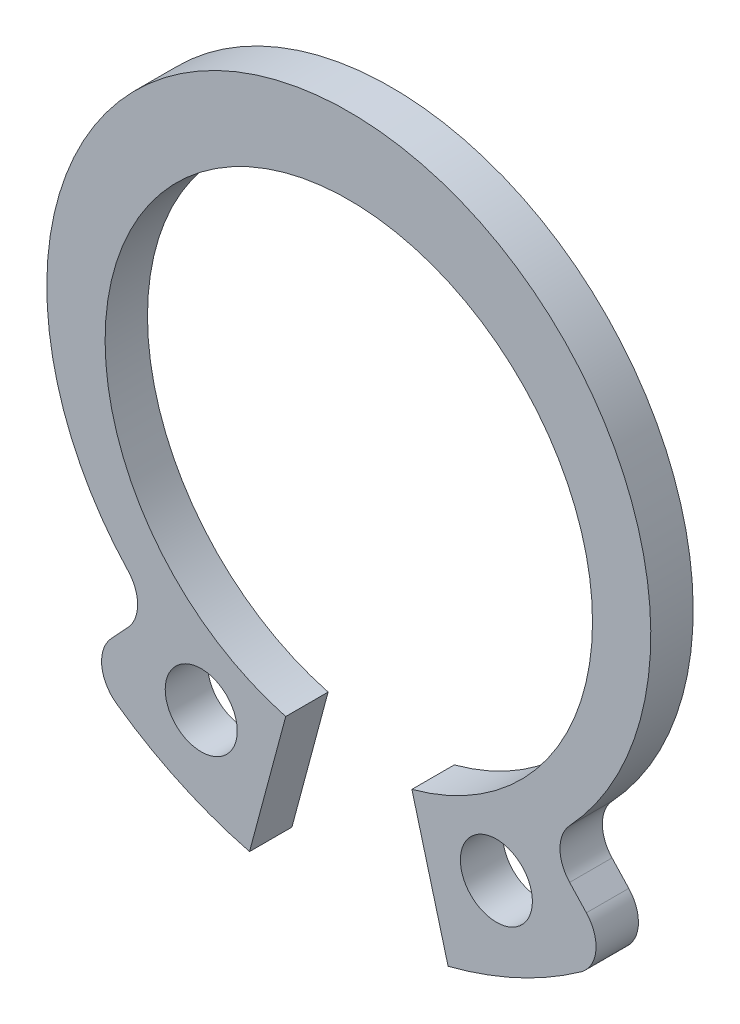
ISO-10303-21;
HEADER;
FILE_DESCRIPTION(('STEP AP214'),'2;1');
FILE_NAME('part.step','',(''),(''),'','','');
FILE_SCHEMA(('AUTOMOTIVE_DESIGN { 1 0 10303 214 1 1 1 1 }'));
ENDSEC;
DATA;
#1=APPLICATION_CONTEXT('core data for automotive mechanical design processes');
#2=APPLICATION_PROTOCOL_DEFINITION('international standard','automotive_design',2000,#1);
#3=PRODUCT_CONTEXT('',#1,'mechanical');
#4=PRODUCT('Part','Part','',(#3));
#5=PRODUCT_RELATED_PRODUCT_CATEGORY('part','',(#4));
#6=PRODUCT_DEFINITION_FORMATION('','',#4);
#7=PRODUCT_DEFINITION_CONTEXT('part definition',#1,'design');
#8=PRODUCT_DEFINITION('design','',#6,#7);
#9=PRODUCT_DEFINITION_SHAPE('','',#8);
#10=(LENGTH_UNIT() NAMED_UNIT(*) SI_UNIT(.MILLI.,.METRE.));
#11=(NAMED_UNIT(*) PLANE_ANGLE_UNIT() SI_UNIT($,.RADIAN.));
#12=(NAMED_UNIT(*) SI_UNIT($,.STERADIAN.) SOLID_ANGLE_UNIT());
#13=UNCERTAINTY_MEASURE_WITH_UNIT(LENGTH_MEASURE(1.E-05),#10,'distance_accuracy_value','');
#14=(GEOMETRIC_REPRESENTATION_CONTEXT(3) GLOBAL_UNCERTAINTY_ASSIGNED_CONTEXT((#13)) GLOBAL_UNIT_ASSIGNED_CONTEXT((#10,
#11,#12)) REPRESENTATION_CONTEXT('',''));
#15=CARTESIAN_POINT('',(0.,0.,0.));
#16=DIRECTION('',(0.,0.,1.));
#17=DIRECTION('',(1.,0.,0.));
#18=AXIS2_PLACEMENT_3D('',#15,#16,#17);
#19=CARTESIAN_POINT('',(-5.83190072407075,-5.01462856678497,1.));
#20=DIRECTION('',(0.,0.,-1.));
#21=DIRECTION('',(-1.,0.,0.));
#22=AXIS2_PLACEMENT_3D('',#19,#20,#21);
#23=PLANE('',#22);
#24=CARTESIAN_POINT('',(3.48167545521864,-6.42252638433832,1.));
#25=DIRECTION('',(0.,0.,1.));
#26=DIRECTION('',(1.,0.,0.));
#27=AXIS2_PLACEMENT_3D('',#24,#25,#26);
#28=CIRCLE('',#27,0.849999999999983);
#29=CARTESIAN_POINT('',(4.33167545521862,-6.42252638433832,1.));
#30=VERTEX_POINT('',#29);
#31=EDGE_CURVE('E136',#30,#30,#28,.T.);
#32=ORIENTED_EDGE('',*,*,#31,.F.);
#33=EDGE_LOOP('',(#32));
#34=FACE_BOUND('',#33,.T.);
#35=CARTESIAN_POINT('',(-5.83190072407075,-5.01462856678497,1.));
#36=DIRECTION('',(0.,0.,-1.));
#37=DIRECTION('',(-1.,0.,0.));
#38=AXIS2_PLACEMENT_3D('',#35,#36,#37);
#39=CIRCLE('',#38,0.85);
#40=CARTESIAN_POINT('',(-5.21031882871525,-4.4348562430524,1.));
#41=VERTEX_POINT('',#40);
#42=CARTESIAN_POINT('',(-5.20988724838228,-5.59393784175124,1.));
#43=VERTEX_POINT('',#42);
#44=EDGE_CURVE('E162',#41,#43,#39,.T.);
#45=ORIENTED_EDGE('',*,*,#44,.T.);
#46=DIRECTION('',(-0.681540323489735,-0.731780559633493,0.));
#47=VECTOR('',#46,1.);
#48=CARTESIAN_POINT('',(-5.20988724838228,-5.59393784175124,1.));
#49=LINE('',#48,#47);
#50=CARTESIAN_POINT('',(-5.60526263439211,-6.01845860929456,1.));
#51=VERTEX_POINT('',#50);
#52=EDGE_CURVE('E131',#43,#51,#49,.T.);
#53=ORIENTED_EDGE('',*,*,#52,.T.);
#54=CARTESIAN_POINT('',(-4.98324915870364,-6.59776788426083,1.));
#55=DIRECTION('',(0.,0.,1.));
#56=DIRECTION('',(-1.,0.,0.));
#57=AXIS2_PLACEMENT_3D('',#54,#55,#56);
#58=CIRCLE('',#57,0.850000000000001);
#59=CARTESIAN_POINT('',(-5.47514140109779,-7.2909792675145,1.));
#60=VERTEX_POINT('',#59);
#61=EDGE_CURVE('E165',#51,#60,#58,.T.);
#62=ORIENTED_EDGE('',*,*,#61,.T.);
#63=CARTESIAN_POINT('',(0.,0.425,1.));
#64=DIRECTION('',(0.,0.,1.));
#65=DIRECTION('',(1.,0.,0.));
#66=AXIS2_PLACEMENT_3D('',#63,#64,#65);
#67=CIRCLE('',#66,9.46115793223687);
#68=CARTESIAN_POINT('',(-2.34231235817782,-8.74162872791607,1.));
#69=VERTEX_POINT('',#68);
#70=EDGE_CURVE('E167',#60,#69,#67,.T.);
#71=ORIENTED_EDGE('',*,*,#70,.T.);
#72=DIRECTION('',(0.258819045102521,0.965925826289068,0.));
#73=VECTOR('',#72,1.);
#74=CARTESIAN_POINT('',(-1.4882095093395,-5.55407350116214,1.));
#75=LINE('',#74,#73);
#76=CARTESIAN_POINT('',(-1.48820950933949,-5.55407350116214,1.));
#77=VERTEX_POINT('',#76);
#78=EDGE_CURVE('E169',#69,#77,#75,.T.);
#79=ORIENTED_EDGE('',*,*,#78,.T.);
#80=CARTESIAN_POINT('',(0.,0.,1.));
#81=DIRECTION('',(0.,0.,-1.));
#82=DIRECTION('',(1.,0.,0.));
#83=AXIS2_PLACEMENT_3D('',#80,#81,#82);
#84=CIRCLE('',#83,5.75);
#85=CARTESIAN_POINT('',(1.4882095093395,-5.55407350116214,1.));
#86=VERTEX_POINT('',#85);
#87=EDGE_CURVE('E171',#77,#86,#84,.T.);
#88=ORIENTED_EDGE('',*,*,#87,.T.);
#89=DIRECTION('',(0.258819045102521,-0.965925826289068,0.));
#90=VECTOR('',#89,1.);
#91=CARTESIAN_POINT('',(1.4882095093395,-5.55407350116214,1.));
#92=LINE('',#91,#90);
#93=CARTESIAN_POINT('',(2.34231235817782,-8.74162872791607,1.));
#94=VERTEX_POINT('',#93);
#95=EDGE_CURVE('E173',#86,#94,#92,.T.);
#96=ORIENTED_EDGE('',*,*,#95,.T.);
#97=CARTESIAN_POINT('',(0.,0.425,1.));
#98=DIRECTION('',(0.,0.,1.));
#99=DIRECTION('',(1.,0.,0.));
#100=AXIS2_PLACEMENT_3D('',#97,#98,#99);
#101=CIRCLE('',#100,9.46115793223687);
#102=CARTESIAN_POINT('',(5.47514140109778,-7.2909792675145,1.));
#103=VERTEX_POINT('',#102);
#104=EDGE_CURVE('E175',#94,#103,#101,.T.);
#105=ORIENTED_EDGE('',*,*,#104,.T.);
#106=CARTESIAN_POINT('',(4.98324915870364,-6.59776788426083,1.));
#107=DIRECTION('',(0.,0.,1.));
#108=DIRECTION('',(1.,0.,0.));
#109=AXIS2_PLACEMENT_3D('',#106,#107,#108);
#110=CIRCLE('',#109,0.850000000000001);
#111=CARTESIAN_POINT('',(5.60526263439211,-6.01845860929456,1.));
#112=VERTEX_POINT('',#111);
#113=EDGE_CURVE('E177',#103,#112,#110,.T.);
#114=ORIENTED_EDGE('',*,*,#113,.T.);
#115=DIRECTION('',(-0.681540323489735,0.731780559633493,0.));
#116=VECTOR('',#115,1.);
#117=CARTESIAN_POINT('',(5.20988724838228,-5.59393784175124,1.));
#118=LINE('',#117,#116);
#119=CARTESIAN_POINT('',(5.20988724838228,-5.59393784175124,1.));
#120=VERTEX_POINT('',#119);
#121=EDGE_CURVE('E179',#112,#120,#118,.T.);
#122=ORIENTED_EDGE('',*,*,#121,.T.);
#123=CARTESIAN_POINT('',(5.83190072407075,-5.01462856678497,1.));
#124=DIRECTION('',(0.,0.,-1.));
#125=DIRECTION('',(1.,0.,0.));
#126=AXIS2_PLACEMENT_3D('',#123,#124,#125);
#127=CIRCLE('',#126,0.85);
#128=CARTESIAN_POINT('',(5.21031882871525,-4.4348562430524,1.));
#129=VERTEX_POINT('',#128);
#130=EDGE_CURVE('E48',#120,#129,#127,.T.);
#131=ORIENTED_EDGE('',*,*,#130,.T.);
#132=CARTESIAN_POINT('',(0.,0.425,1.));
#133=DIRECTION('',(0.,0.,1.));
#134=DIRECTION('',(1.,0.,0.));
#135=AXIS2_PLACEMENT_3D('',#132,#133,#134);
#136=CIRCLE('',#135,7.125);
#137=EDGE_CURVE('E43',#129,#41,#136,.T.);
#138=ORIENTED_EDGE('',*,*,#137,.T.);
#139=EDGE_LOOP('',(#45,#53,#62,#71,#79,#88,#96,#105,#114,#122,#131,#138));
#140=FACE_BOUND('',#139,.T.);
#141=CARTESIAN_POINT('',(-3.48167545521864,-6.42252638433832,1.));
#142=DIRECTION('',(0.,0.,1.));
#143=DIRECTION('',(-1.,0.,0.));
#144=AXIS2_PLACEMENT_3D('',#141,#142,#143);
#145=CIRCLE('',#144,0.85);
#146=CARTESIAN_POINT('',(-4.33167545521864,-6.42252638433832,1.));
#147=VERTEX_POINT('',#146);
#148=EDGE_CURVE('E282',#147,#147,#145,.T.);
#149=ORIENTED_EDGE('',*,*,#148,.F.);
#150=EDGE_LOOP('',(#149));
#151=FACE_BOUND('',#150,.T.);
#152=ADVANCED_FACE('F28',(#34,#140,#151),#23,.F.);
#153=CARTESIAN_POINT('',(-5.83190072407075,-5.01462856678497,0.));
#154=DIRECTION('',(0.,0.,-1.));
#155=DIRECTION('',(-1.,0.,0.));
#156=AXIS2_PLACEMENT_3D('',#153,#154,#155);
#157=PLANE('',#156);
#158=CARTESIAN_POINT('',(3.48167545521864,-6.42252638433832,0.));
#159=DIRECTION('',(0.,0.,1.));
#160=DIRECTION('',(1.,0.,0.));
#161=AXIS2_PLACEMENT_3D('',#158,#159,#160);
#162=CIRCLE('',#161,0.849999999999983);
#163=CARTESIAN_POINT('',(4.33167545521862,-6.42252638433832,0.));
#164=VERTEX_POINT('',#163);
#165=EDGE_CURVE('E139',#164,#164,#162,.T.);
#166=ORIENTED_EDGE('',*,*,#165,.T.);
#167=EDGE_LOOP('',(#166));
#168=FACE_BOUND('',#167,.T.);
#169=CARTESIAN_POINT('',(-5.83190072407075,-5.01462856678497,0.));
#170=DIRECTION('',(0.,0.,-1.));
#171=DIRECTION('',(-1.,0.,0.));
#172=AXIS2_PLACEMENT_3D('',#169,#170,#171);
#173=CIRCLE('',#172,0.85);
#174=CARTESIAN_POINT('',(-5.21031882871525,-4.4348562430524,0.));
#175=VERTEX_POINT('',#174);
#176=CARTESIAN_POINT('',(-5.20988724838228,-5.59393784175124,0.));
#177=VERTEX_POINT('',#176);
#178=EDGE_CURVE('E122',#175,#177,#173,.T.);
#179=ORIENTED_EDGE('',*,*,#178,.F.);
#180=CARTESIAN_POINT('',(0.,0.425,0.));
#181=DIRECTION('',(0.,0.,1.));
#182=DIRECTION('',(1.,0.,0.));
#183=AXIS2_PLACEMENT_3D('',#180,#181,#182);
#184=CIRCLE('',#183,7.125);
#185=CARTESIAN_POINT('',(5.21031882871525,-4.4348562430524,0.));
#186=VERTEX_POINT('',#185);
#187=EDGE_CURVE('E160',#186,#175,#184,.T.);
#188=ORIENTED_EDGE('',*,*,#187,.F.);
#189=CARTESIAN_POINT('',(5.83190072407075,-5.01462856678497,0.));
#190=DIRECTION('',(0.,0.,-1.));
#191=DIRECTION('',(1.,0.,0.));
#192=AXIS2_PLACEMENT_3D('',#189,#190,#191);
#193=CIRCLE('',#192,0.85);
#194=CARTESIAN_POINT('',(5.20988724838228,-5.59393784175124,0.));
#195=VERTEX_POINT('',#194);
#196=EDGE_CURVE('E158',#195,#186,#193,.T.);
#197=ORIENTED_EDGE('',*,*,#196,.F.);
#198=DIRECTION('',(-0.681540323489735,0.731780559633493,0.));
#199=VECTOR('',#198,1.);
#200=CARTESIAN_POINT('',(5.20988724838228,-5.59393784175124,0.));
#201=LINE('',#200,#199);
#202=CARTESIAN_POINT('',(5.60526263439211,-6.01845860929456,0.));
#203=VERTEX_POINT('',#202);
#204=EDGE_CURVE('E156',#203,#195,#201,.T.);
#205=ORIENTED_EDGE('',*,*,#204,.F.);
#206=CARTESIAN_POINT('',(4.98324915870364,-6.59776788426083,0.));
#207=DIRECTION('',(0.,0.,1.));
#208=DIRECTION('',(1.,0.,0.));
#209=AXIS2_PLACEMENT_3D('',#206,#207,#208);
#210=CIRCLE('',#209,0.850000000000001);
#211=CARTESIAN_POINT('',(5.47514140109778,-7.2909792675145,0.));
#212=VERTEX_POINT('',#211);
#213=EDGE_CURVE('E154',#212,#203,#210,.T.);
#214=ORIENTED_EDGE('',*,*,#213,.F.);
#215=CARTESIAN_POINT('',(0.,0.425,0.));
#216=DIRECTION('',(0.,0.,1.));
#217=DIRECTION('',(1.,0.,0.));
#218=AXIS2_PLACEMENT_3D('',#215,#216,#217);
#219=CIRCLE('',#218,9.46115793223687);
#220=CARTESIAN_POINT('',(2.34231235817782,-8.74162872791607,0.));
#221=VERTEX_POINT('',#220);
#222=EDGE_CURVE('E152',#221,#212,#219,.T.);
#223=ORIENTED_EDGE('',*,*,#222,.F.);
#224=DIRECTION('',(0.258819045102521,-0.965925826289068,0.));
#225=VECTOR('',#224,1.);
#226=CARTESIAN_POINT('',(1.4882095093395,-5.55407350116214,0.));
#227=LINE('',#226,#225);
#228=CARTESIAN_POINT('',(1.4882095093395,-5.55407350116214,0.));
#229=VERTEX_POINT('',#228);
#230=EDGE_CURVE('E150',#229,#221,#227,.T.);
#231=ORIENTED_EDGE('',*,*,#230,.F.);
#232=CARTESIAN_POINT('',(0.,0.,0.));
#233=DIRECTION('',(0.,0.,-1.));
#234=DIRECTION('',(1.,0.,0.));
#235=AXIS2_PLACEMENT_3D('',#232,#233,#234);
#236=CIRCLE('',#235,5.75);
#237=CARTESIAN_POINT('',(-1.48820950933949,-5.55407350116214,0.));
#238=VERTEX_POINT('',#237);
#239=EDGE_CURVE('E148',#238,#229,#236,.T.);
#240=ORIENTED_EDGE('',*,*,#239,.F.);
#241=DIRECTION('',(0.258819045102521,0.965925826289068,0.));
#242=VECTOR('',#241,1.);
#243=CARTESIAN_POINT('',(-1.4882095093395,-5.55407350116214,0.));
#244=LINE('',#243,#242);
#245=CARTESIAN_POINT('',(-2.34231235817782,-8.74162872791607,0.));
#246=VERTEX_POINT('',#245);
#247=EDGE_CURVE('E146',#246,#238,#244,.T.);
#248=ORIENTED_EDGE('',*,*,#247,.F.);
#249=CARTESIAN_POINT('',(0.,0.425,0.));
#250=DIRECTION('',(0.,0.,1.));
#251=DIRECTION('',(1.,0.,0.));
#252=AXIS2_PLACEMENT_3D('',#249,#250,#251);
#253=CIRCLE('',#252,9.46115793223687);
#254=CARTESIAN_POINT('',(-5.47514140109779,-7.2909792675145,0.));
#255=VERTEX_POINT('',#254);
#256=EDGE_CURVE('E144',#255,#246,#253,.T.);
#257=ORIENTED_EDGE('',*,*,#256,.F.);
#258=CARTESIAN_POINT('',(-4.98324915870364,-6.59776788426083,0.));
#259=DIRECTION('',(0.,0.,1.));
#260=DIRECTION('',(-1.,0.,0.));
#261=AXIS2_PLACEMENT_3D('',#258,#259,#260);
#262=CIRCLE('',#261,0.850000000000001);
#263=CARTESIAN_POINT('',(-5.60526263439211,-6.01845860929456,0.));
#264=VERTEX_POINT('',#263);
#265=EDGE_CURVE('E124',#264,#255,#262,.T.);
#266=ORIENTED_EDGE('',*,*,#265,.F.);
#267=DIRECTION('',(-0.681540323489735,-0.731780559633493,0.));
#268=VECTOR('',#267,1.);
#269=CARTESIAN_POINT('',(-5.20988724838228,-5.59393784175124,0.));
#270=LINE('',#269,#268);
#271=EDGE_CURVE('E117',#177,#264,#270,.T.);
#272=ORIENTED_EDGE('',*,*,#271,.F.);
#273=EDGE_LOOP('',(#179,#188,#197,#205,#214,#223,#231,#240,#248,#257,#266,#272));
#274=FACE_BOUND('',#273,.T.);
#275=CARTESIAN_POINT('',(-3.48167545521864,-6.42252638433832,0.));
#276=DIRECTION('',(0.,0.,1.));
#277=DIRECTION('',(-1.,0.,0.));
#278=AXIS2_PLACEMENT_3D('',#275,#276,#277);
#279=CIRCLE('',#278,0.85);
#280=CARTESIAN_POINT('',(-4.33167545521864,-6.42252638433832,0.));
#281=VERTEX_POINT('',#280);
#282=EDGE_CURVE('E285',#281,#281,#279,.T.);
#283=ORIENTED_EDGE('',*,*,#282,.T.);
#284=EDGE_LOOP('',(#283));
#285=FACE_BOUND('',#284,.T.);
#286=ADVANCED_FACE('F118',(#168,#274,#285),#157,.T.);
#287=CARTESIAN_POINT('',(-5.83190072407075,-5.01462856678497,1.));
#288=DIRECTION('',(0.,0.,-1.));
#289=DIRECTION('',(-1.,0.,0.));
#290=AXIS2_PLACEMENT_3D('',#287,#288,#289);
#291=CYLINDRICAL_SURFACE('',#290,0.85);
#292=ORIENTED_EDGE('',*,*,#178,.T.);
#293=DIRECTION('',(0.,0.,-1.));
#294=VECTOR('',#293,1.);
#295=CARTESIAN_POINT('',(-5.20988724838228,-5.59393784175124,1.));
#296=LINE('',#295,#294);
#297=EDGE_CURVE('E11',#43,#177,#296,.T.);
#298=ORIENTED_EDGE('',*,*,#297,.F.);
#299=ORIENTED_EDGE('',*,*,#44,.F.);
#300=DIRECTION('',(0.,0.,-1.));
#301=VECTOR('',#300,1.);
#302=CARTESIAN_POINT('',(-5.21031882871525,-4.4348562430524,1.));
#303=LINE('',#302,#301);
#304=EDGE_CURVE('E135',#41,#175,#303,.T.);
#305=ORIENTED_EDGE('',*,*,#304,.T.);
#306=EDGE_LOOP('',(#292,#298,#299,#305));
#307=FACE_BOUND('',#306,.T.);
#308=ADVANCED_FACE('F30',(#307),#291,.F.);
#309=CARTESIAN_POINT('',(-5.20988724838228,-5.59393784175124,1.));
#310=DIRECTION('',(0.731780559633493,-0.681540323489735,0.));
#311=DIRECTION('',(0.681540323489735,0.731780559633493,0.));
#312=AXIS2_PLACEMENT_3D('',#309,#310,#311);
#313=PLANE('',#312);
#314=ORIENTED_EDGE('',*,*,#271,.T.);
#315=DIRECTION('',(0.,0.,-1.));
#316=VECTOR('',#315,1.);
#317=CARTESIAN_POINT('',(-5.60526263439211,-6.01845860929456,1.));
#318=LINE('',#317,#316);
#319=EDGE_CURVE('E36',#51,#264,#318,.T.);
#320=ORIENTED_EDGE('',*,*,#319,.F.);
#321=ORIENTED_EDGE('',*,*,#52,.F.);
#322=ORIENTED_EDGE('',*,*,#297,.T.);
#323=EDGE_LOOP('',(#314,#320,#321,#322));
#324=FACE_BOUND('',#323,.T.);
#325=ADVANCED_FACE('F130',(#324),#313,.F.);
#326=CARTESIAN_POINT('',(-4.98324915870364,-6.59776788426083,1.));
#327=DIRECTION('',(0.,0.,-1.));
#328=DIRECTION('',(-1.,0.,0.));
#329=AXIS2_PLACEMENT_3D('',#326,#327,#328);
#330=CYLINDRICAL_SURFACE('',#329,0.850000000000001);
#331=ORIENTED_EDGE('',*,*,#265,.T.);
#332=DIRECTION('',(0.,0.,-1.));
#333=VECTOR('',#332,1.);
#334=CARTESIAN_POINT('',(-5.47514140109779,-7.2909792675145,1.));
#335=LINE('',#334,#333);
#336=EDGE_CURVE('E208',#60,#255,#335,.T.);
#337=ORIENTED_EDGE('',*,*,#336,.F.);
#338=ORIENTED_EDGE('',*,*,#61,.F.);
#339=ORIENTED_EDGE('',*,*,#319,.T.);
#340=EDGE_LOOP('',(#331,#337,#338,#339));
#341=FACE_BOUND('',#340,.T.);
#342=ADVANCED_FACE('F212',(#341),#330,.T.);
#343=CARTESIAN_POINT('',(0.,0.425,1.));
#344=DIRECTION('',(0.,0.,-1.));
#345=DIRECTION('',(-1.,0.,0.));
#346=AXIS2_PLACEMENT_3D('',#343,#344,#345);
#347=CYLINDRICAL_SURFACE('',#346,9.46115793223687);
#348=ORIENTED_EDGE('',*,*,#256,.T.);
#349=DIRECTION('',(0.,0.,-1.));
#350=VECTOR('',#349,1.);
#351=CARTESIAN_POINT('',(-2.34231235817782,-8.74162872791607,1.));
#352=LINE('',#351,#350);
#353=EDGE_CURVE('E205',#69,#246,#352,.T.);
#354=ORIENTED_EDGE('',*,*,#353,.F.);
#355=ORIENTED_EDGE('',*,*,#70,.F.);
#356=ORIENTED_EDGE('',*,*,#336,.T.);
#357=EDGE_LOOP('',(#348,#354,#355,#356));
#358=FACE_BOUND('',#357,.T.);
#359=ADVANCED_FACE('F220',(#358),#347,.T.);
#360=CARTESIAN_POINT('',(-1.4882095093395,-5.55407350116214,1.));
#361=DIRECTION('',(-0.965925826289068,0.258819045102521,0.));
#362=DIRECTION('',(-0.258819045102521,-0.965925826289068,0.));
#363=AXIS2_PLACEMENT_3D('',#360,#361,#362);
#364=PLANE('',#363);
#365=ORIENTED_EDGE('',*,*,#247,.T.);
#366=DIRECTION('',(0.,0.,-1.));
#367=VECTOR('',#366,1.);
#368=CARTESIAN_POINT('',(-1.48820950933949,-5.55407350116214,1.));
#369=LINE('',#368,#367);
#370=EDGE_CURVE('E202',#77,#238,#369,.T.);
#371=ORIENTED_EDGE('',*,*,#370,.F.);
#372=ORIENTED_EDGE('',*,*,#78,.F.);
#373=ORIENTED_EDGE('',*,*,#353,.T.);
#374=EDGE_LOOP('',(#365,#371,#372,#373));
#375=FACE_BOUND('',#374,.T.);
#376=ADVANCED_FACE('F223',(#375),#364,.F.);
#377=CARTESIAN_POINT('',(0.,0.,1.));
#378=DIRECTION('',(0.,0.,-1.));
#379=DIRECTION('',(-1.,0.,0.));
#380=AXIS2_PLACEMENT_3D('',#377,#378,#379);
#381=CYLINDRICAL_SURFACE('',#380,5.75);
#382=ORIENTED_EDGE('',*,*,#239,.T.);
#383=DIRECTION('',(0.,0.,-1.));
#384=VECTOR('',#383,1.);
#385=CARTESIAN_POINT('',(1.4882095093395,-5.55407350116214,1.));
#386=LINE('',#385,#384);
#387=EDGE_CURVE('E199',#86,#229,#386,.T.);
#388=ORIENTED_EDGE('',*,*,#387,.F.);
#389=ORIENTED_EDGE('',*,*,#87,.F.);
#390=ORIENTED_EDGE('',*,*,#370,.T.);
#391=EDGE_LOOP('',(#382,#388,#389,#390));
#392=FACE_BOUND('',#391,.T.);
#393=ADVANCED_FACE('F228',(#392),#381,.F.);
#394=CARTESIAN_POINT('',(1.4882095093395,-5.55407350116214,1.));
#395=DIRECTION('',(0.965925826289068,0.258819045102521,0.));
#396=DIRECTION('',(-0.258819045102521,0.965925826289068,0.));
#397=AXIS2_PLACEMENT_3D('',#394,#395,#396);
#398=PLANE('',#397);
#399=ORIENTED_EDGE('',*,*,#230,.T.);
#400=DIRECTION('',(0.,0.,-1.));
#401=VECTOR('',#400,1.);
#402=CARTESIAN_POINT('',(2.34231235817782,-8.74162872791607,1.));
#403=LINE('',#402,#401);
#404=EDGE_CURVE('E196',#94,#221,#403,.T.);
#405=ORIENTED_EDGE('',*,*,#404,.F.);
#406=ORIENTED_EDGE('',*,*,#95,.F.);
#407=ORIENTED_EDGE('',*,*,#387,.T.);
#408=EDGE_LOOP('',(#399,#405,#406,#407));
#409=FACE_BOUND('',#408,.T.);
#410=ADVANCED_FACE('F234',(#409),#398,.F.);
#411=CARTESIAN_POINT('',(0.,0.425,1.));
#412=DIRECTION('',(0.,0.,-1.));
#413=DIRECTION('',(-1.,0.,0.));
#414=AXIS2_PLACEMENT_3D('',#411,#412,#413);
#415=CYLINDRICAL_SURFACE('',#414,9.46115793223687);
#416=ORIENTED_EDGE('',*,*,#222,.T.);
#417=DIRECTION('',(0.,0.,-1.));
#418=VECTOR('',#417,1.);
#419=CARTESIAN_POINT('',(5.47514140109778,-7.2909792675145,1.));
#420=LINE('',#419,#418);
#421=EDGE_CURVE('E193',#103,#212,#420,.T.);
#422=ORIENTED_EDGE('',*,*,#421,.F.);
#423=ORIENTED_EDGE('',*,*,#104,.F.);
#424=ORIENTED_EDGE('',*,*,#404,.T.);
#425=EDGE_LOOP('',(#416,#422,#423,#424));
#426=FACE_BOUND('',#425,.T.);
#427=ADVANCED_FACE('F238',(#426),#415,.T.);
#428=CARTESIAN_POINT('',(4.98324915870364,-6.59776788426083,1.));
#429=DIRECTION('',(0.,0.,-1.));
#430=DIRECTION('',(-1.,0.,0.));
#431=AXIS2_PLACEMENT_3D('',#428,#429,#430);
#432=CYLINDRICAL_SURFACE('',#431,0.850000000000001);
#433=ORIENTED_EDGE('',*,*,#213,.T.);
#434=DIRECTION('',(0.,0.,-1.));
#435=VECTOR('',#434,1.);
#436=CARTESIAN_POINT('',(5.60526263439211,-6.01845860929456,1.));
#437=LINE('',#436,#435);
#438=EDGE_CURVE('E190',#112,#203,#437,.T.);
#439=ORIENTED_EDGE('',*,*,#438,.F.);
#440=ORIENTED_EDGE('',*,*,#113,.F.);
#441=ORIENTED_EDGE('',*,*,#421,.T.);
#442=EDGE_LOOP('',(#433,#439,#440,#441));
#443=FACE_BOUND('',#442,.T.);
#444=ADVANCED_FACE('F243',(#443),#432,.T.);
#445=CARTESIAN_POINT('',(5.20988724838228,-5.59393784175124,1.));
#446=DIRECTION('',(-0.731780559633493,-0.681540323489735,0.));
#447=DIRECTION('',(0.681540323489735,-0.731780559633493,0.));
#448=AXIS2_PLACEMENT_3D('',#445,#446,#447);
#449=PLANE('',#448);
#450=ORIENTED_EDGE('',*,*,#204,.T.);
#451=DIRECTION('',(0.,0.,-1.));
#452=VECTOR('',#451,1.);
#453=CARTESIAN_POINT('',(5.20988724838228,-5.59393784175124,1.));
#454=LINE('',#453,#452);
#455=EDGE_CURVE('E187',#120,#195,#454,.T.);
#456=ORIENTED_EDGE('',*,*,#455,.F.);
#457=ORIENTED_EDGE('',*,*,#121,.F.);
#458=ORIENTED_EDGE('',*,*,#438,.T.);
#459=EDGE_LOOP('',(#450,#456,#457,#458));
#460=FACE_BOUND('',#459,.T.);
#461=ADVANCED_FACE('F247',(#460),#449,.F.);
#462=CARTESIAN_POINT('',(5.83190072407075,-5.01462856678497,1.));
#463=DIRECTION('',(0.,0.,-1.));
#464=DIRECTION('',(-1.,0.,0.));
#465=AXIS2_PLACEMENT_3D('',#462,#463,#464);
#466=CYLINDRICAL_SURFACE('',#465,0.85);
#467=ORIENTED_EDGE('',*,*,#196,.T.);
#468=DIRECTION('',(0.,0.,-1.));
#469=VECTOR('',#468,1.);
#470=CARTESIAN_POINT('',(5.21031882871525,-4.4348562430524,1.));
#471=LINE('',#470,#469);
#472=EDGE_CURVE('E184',#129,#186,#471,.T.);
#473=ORIENTED_EDGE('',*,*,#472,.F.);
#474=ORIENTED_EDGE('',*,*,#130,.F.);
#475=ORIENTED_EDGE('',*,*,#455,.T.);
#476=EDGE_LOOP('',(#467,#473,#474,#475));
#477=FACE_BOUND('',#476,.T.);
#478=ADVANCED_FACE('F251',(#477),#466,.F.);
#479=CARTESIAN_POINT('',(0.,0.425,1.));
#480=DIRECTION('',(0.,0.,-1.));
#481=DIRECTION('',(-1.,0.,0.));
#482=AXIS2_PLACEMENT_3D('',#479,#480,#481);
#483=CYLINDRICAL_SURFACE('',#482,7.125);
#484=ORIENTED_EDGE('',*,*,#187,.T.);
#485=ORIENTED_EDGE('',*,*,#304,.F.);
#486=ORIENTED_EDGE('',*,*,#137,.F.);
#487=ORIENTED_EDGE('',*,*,#472,.T.);
#488=EDGE_LOOP('',(#484,#485,#486,#487));
#489=FACE_BOUND('',#488,.T.);
#490=ADVANCED_FACE('F253',(#489),#483,.T.);
#491=CARTESIAN_POINT('',(3.48167545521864,-6.42252638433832,1.));
#492=DIRECTION('',(0.,0.,-1.));
#493=DIRECTION('',(-1.,0.,0.));
#494=AXIS2_PLACEMENT_3D('',#491,#492,#493);
#495=CYLINDRICAL_SURFACE('',#494,0.849999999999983);
#496=ORIENTED_EDGE('',*,*,#31,.T.);
#497=EDGE_LOOP('',(#496));
#498=FACE_BOUND('',#497,.T.);
#499=ORIENTED_EDGE('',*,*,#165,.F.);
#500=EDGE_LOOP('',(#499));
#501=FACE_BOUND('',#500,.T.);
#502=ADVANCED_FACE('F255',(#498,#501),#495,.F.);
#503=CARTESIAN_POINT('',(-3.48167545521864,-6.42252638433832,1.));
#504=DIRECTION('',(0.,0.,-1.));
#505=DIRECTION('',(-1.,0.,0.));
#506=AXIS2_PLACEMENT_3D('',#503,#504,#505);
#507=CYLINDRICAL_SURFACE('',#506,0.85);
#508=ORIENTED_EDGE('',*,*,#148,.T.);
#509=EDGE_LOOP('',(#508));
#510=FACE_BOUND('',#509,.T.);
#511=ORIENTED_EDGE('',*,*,#282,.F.);
#512=EDGE_LOOP('',(#511));
#513=FACE_BOUND('',#512,.T.);
#514=ADVANCED_FACE('F261',(#510,#513),#507,.F.);
#515=CLOSED_SHELL('',(#152,#286,#308,#325,#342,#359,#376,#393,#410,#427,#444,#461,#478,#490,
#502,#514));
#516=MANIFOLD_SOLID_BREP('B2',#515);
#517=ADVANCED_BREP_SHAPE_REPRESENTATION('',(#18,#516),#14);
#518=SHAPE_DEFINITION_REPRESENTATION(#9,#517);
ENDSEC;
END-ISO-10303-21;
